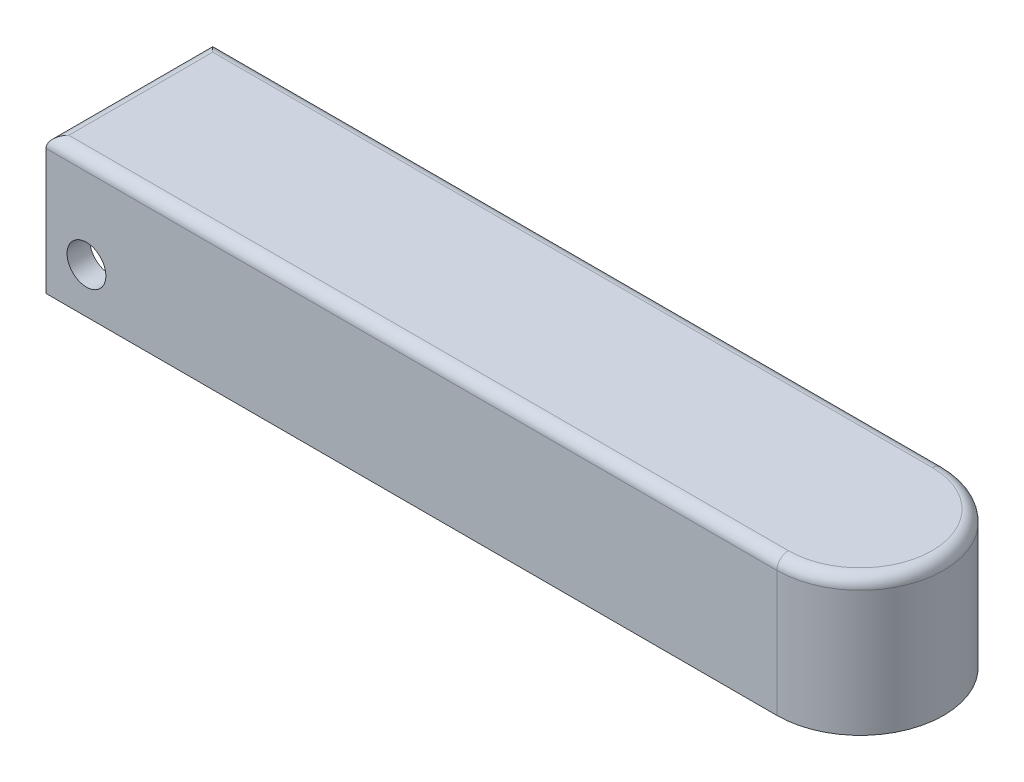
ISO-10303-21;
HEADER;
FILE_DESCRIPTION(('STEP AP214'),'2;1');
FILE_NAME('part.step','',(''),(''),'','','');
FILE_SCHEMA(('AUTOMOTIVE_DESIGN { 1 0 10303 214 1 1 1 1 }'));
ENDSEC;
DATA;
#1=APPLICATION_CONTEXT('core data for automotive mechanical design processes');
#2=APPLICATION_PROTOCOL_DEFINITION('international standard','automotive_design',2000,#1);
#3=PRODUCT_CONTEXT('',#1,'mechanical');
#4=PRODUCT('Part','Part','',(#3));
#5=PRODUCT_RELATED_PRODUCT_CATEGORY('part','',(#4));
#6=PRODUCT_DEFINITION_FORMATION('','',#4);
#7=PRODUCT_DEFINITION_CONTEXT('part definition',#1,'design');
#8=PRODUCT_DEFINITION('design','',#6,#7);
#9=PRODUCT_DEFINITION_SHAPE('','',#8);
#10=(LENGTH_UNIT() NAMED_UNIT(*) SI_UNIT(.MILLI.,.METRE.));
#11=(NAMED_UNIT(*) PLANE_ANGLE_UNIT() SI_UNIT($,.RADIAN.));
#12=(NAMED_UNIT(*) SI_UNIT($,.STERADIAN.) SOLID_ANGLE_UNIT());
#13=UNCERTAINTY_MEASURE_WITH_UNIT(LENGTH_MEASURE(1.E-05),#10,'distance_accuracy_value','');
#14=(GEOMETRIC_REPRESENTATION_CONTEXT(3) GLOBAL_UNCERTAINTY_ASSIGNED_CONTEXT((#13)) GLOBAL_UNIT_ASSIGNED_CONTEXT((#10,
#11,#12)) REPRESENTATION_CONTEXT('',''));
#15=CARTESIAN_POINT('',(0.,0.,0.));
#16=DIRECTION('',(0.,0.,1.));
#17=DIRECTION('',(1.,0.,0.));
#18=AXIS2_PLACEMENT_3D('',#15,#16,#17);
#19=CARTESIAN_POINT('',(0.,76.2,0.));
#20=DIRECTION('',(1.,0.,0.));
#21=DIRECTION('',(0.,0.,-1.));
#22=AXIS2_PLACEMENT_3D('',#19,#20,#21);
#23=PLANE('',#22);
#24=DIRECTION('',(0.,-1.,0.));
#25=VECTOR('',#24,1.);
#26=CARTESIAN_POINT('',(0.,76.2,0.));
#27=LINE('',#26,#25);
#28=CARTESIAN_POINT('',(0.,69.85,0.));
#29=VERTEX_POINT('',#28);
#30=CARTESIAN_POINT('',(0.,0.,0.));
#31=VERTEX_POINT('',#30);
#32=EDGE_CURVE('E196',#29,#31,#27,.T.);
#33=ORIENTED_EDGE('',*,*,#32,.F.);
#34=DIRECTION('',(0.,0.,1.));
#35=VECTOR('',#34,1.);
#36=CARTESIAN_POINT('',(0.,69.85,0.));
#37=LINE('',#36,#35);
#38=CARTESIAN_POINT('',(0.,69.85,-92.71));
#39=VERTEX_POINT('',#38);
#40=EDGE_CURVE('E39',#29,#39,#37,.F.);
#41=ORIENTED_EDGE('',*,*,#40,.T.);
#42=DIRECTION('',(0.,-1.,0.));
#43=VECTOR('',#42,1.);
#44=CARTESIAN_POINT('',(0.,76.2,-92.71));
#45=LINE('',#44,#43);
#46=CARTESIAN_POINT('',(0.,0.,-92.71));
#47=VERTEX_POINT('',#46);
#48=EDGE_CURVE('E190',#39,#47,#45,.T.);
#49=ORIENTED_EDGE('',*,*,#48,.T.);
#50=DIRECTION('',(0.,0.,1.));
#51=VECTOR('',#50,1.);
#52=CARTESIAN_POINT('',(0.,0.,0.));
#53=LINE('',#52,#51);
#54=CARTESIAN_POINT('',(0.,0.,-80.01));
#55=VERTEX_POINT('',#54);
#56=EDGE_CURVE('E126',#47,#55,#53,.T.);
#57=ORIENTED_EDGE('',*,*,#56,.T.);
#58=DIRECTION('',(0.,-1.,0.));
#59=VECTOR('',#58,1.);
#60=CARTESIAN_POINT('',(0.,38.1,-80.01));
#61=LINE('',#60,#59);
#62=CARTESIAN_POINT('',(0.,63.5,-80.01));
#63=VERTEX_POINT('',#62);
#64=EDGE_CURVE('E120',#63,#55,#61,.T.);
#65=ORIENTED_EDGE('',*,*,#64,.F.);
#66=DIRECTION('',(0.,0.,-1.));
#67=VECTOR('',#66,1.);
#68=CARTESIAN_POINT('',(0.,63.5,-80.01));
#69=LINE('',#68,#67);
#70=CARTESIAN_POINT('',(0.,63.5,-12.7));
#71=VERTEX_POINT('',#70);
#72=EDGE_CURVE('E124',#71,#63,#69,.T.);
#73=ORIENTED_EDGE('',*,*,#72,.F.);
#74=DIRECTION('',(0.,-1.,0.));
#75=VECTOR('',#74,1.);
#76=CARTESIAN_POINT('',(0.,38.1,-12.7));
#77=LINE('',#76,#75);
#78=CARTESIAN_POINT('',(0.,0.,-12.7));
#79=VERTEX_POINT('',#78);
#80=EDGE_CURVE('E131',#71,#79,#77,.T.);
#81=ORIENTED_EDGE('',*,*,#80,.T.);
#82=EDGE_CURVE('E177',#79,#31,#53,.T.);
#83=ORIENTED_EDGE('',*,*,#82,.T.);
#84=EDGE_LOOP('',(#33,#41,#49,#57,#65,#73,#81,#83));
#85=FACE_BOUND('',#84,.T.);
#86=ADVANCED_FACE('F30',(#85),#23,.F.);
#87=CARTESIAN_POINT('',(0.,76.2,0.));
#88=DIRECTION('',(0.,0.,-1.));
#89=DIRECTION('',(-1.,0.,0.));
#90=AXIS2_PLACEMENT_3D('',#87,#88,#89);
#91=PLANE('',#90);
#92=CARTESIAN_POINT('',(22.4900013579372,25.1025379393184,0.));
#93=DIRECTION('',(0.,0.,1.));
#94=DIRECTION('',(1.,0.,0.));
#95=AXIS2_PLACEMENT_3D('',#92,#93,#94);
#96=CIRCLE('',#95,10.7961289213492);
#97=CARTESIAN_POINT('',(33.2861302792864,25.1025379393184,0.));
#98=VERTEX_POINT('',#97);
#99=EDGE_CURVE('E226',#98,#98,#96,.T.);
#100=ORIENTED_EDGE('',*,*,#99,.F.);
#101=EDGE_LOOP('',(#100));
#102=FACE_BOUND('',#101,.T.);
#103=DIRECTION('',(0.,-1.,0.));
#104=VECTOR('',#103,1.);
#105=CARTESIAN_POINT('',(406.4,76.2,0.));
#106=LINE('',#105,#104);
#107=CARTESIAN_POINT('',(406.4,69.85,0.));
#108=VERTEX_POINT('',#107);
#109=CARTESIAN_POINT('',(406.4,0.,0.));
#110=VERTEX_POINT('',#109);
#111=EDGE_CURVE('E194',#108,#110,#106,.T.);
#112=ORIENTED_EDGE('',*,*,#111,.F.);
#113=DIRECTION('',(1.,0.,0.));
#114=VECTOR('',#113,1.);
#115=CARTESIAN_POINT('',(0.,69.85,0.));
#116=LINE('',#115,#114);
#117=EDGE_CURVE('E11',#108,#29,#116,.F.);
#118=ORIENTED_EDGE('',*,*,#117,.T.);
#119=ORIENTED_EDGE('',*,*,#32,.T.);
#120=DIRECTION('',(1.,0.,0.));
#121=VECTOR('',#120,1.);
#122=CARTESIAN_POINT('',(0.,0.,0.));
#123=LINE('',#122,#121);
#124=EDGE_CURVE('E181',#31,#110,#123,.T.);
#125=ORIENTED_EDGE('',*,*,#124,.T.);
#126=EDGE_LOOP('',(#112,#118,#119,#125));
#127=FACE_BOUND('',#126,.T.);
#128=ADVANCED_FACE('F263',(#102,#127),#91,.F.);
#129=CARTESIAN_POINT('',(406.4,76.2,-46.355));
#130=DIRECTION('',(0.,-1.,0.));
#131=DIRECTION('',(0.,0.,-1.));
#132=AXIS2_PLACEMENT_3D('',#129,#130,#131);
#133=CYLINDRICAL_SURFACE('',#132,46.355);
#134=DIRECTION('',(0.,-1.,0.));
#135=VECTOR('',#134,1.);
#136=CARTESIAN_POINT('',(406.4,76.2,-92.71));
#137=LINE('',#136,#135);
#138=CARTESIAN_POINT('',(406.4,69.85,-92.71));
#139=VERTEX_POINT('',#138);
#140=CARTESIAN_POINT('',(406.4,0.,-92.71));
#141=VERTEX_POINT('',#140);
#142=EDGE_CURVE('E192',#139,#141,#137,.T.);
#143=ORIENTED_EDGE('',*,*,#142,.F.);
#144=CARTESIAN_POINT('',(406.4,69.85,-46.355));
#145=DIRECTION('',(0.,-1.,0.));
#146=DIRECTION('',(0.,0.,-1.));
#147=AXIS2_PLACEMENT_3D('',#144,#145,#146);
#148=CIRCLE('',#147,46.355);
#149=EDGE_CURVE('E53',#139,#108,#148,.T.);
#150=ORIENTED_EDGE('',*,*,#149,.T.);
#151=ORIENTED_EDGE('',*,*,#111,.T.);
#152=CARTESIAN_POINT('',(406.4,0.,-46.355));
#153=DIRECTION('',(0.,1.,0.));
#154=DIRECTION('',(0.,0.,-1.));
#155=AXIS2_PLACEMENT_3D('',#152,#153,#154);
#156=CIRCLE('',#155,46.355);
#157=EDGE_CURVE('E184',#110,#141,#156,.T.);
#158=ORIENTED_EDGE('',*,*,#157,.T.);
#159=EDGE_LOOP('',(#143,#150,#151,#158));
#160=FACE_BOUND('',#159,.T.);
#161=ADVANCED_FACE('F268',(#160),#133,.T.);
#162=CARTESIAN_POINT('',(0.,76.2,-92.71));
#163=DIRECTION('',(0.,0.,1.));
#164=DIRECTION('',(1.,0.,0.));
#165=AXIS2_PLACEMENT_3D('',#162,#163,#164);
#166=PLANE('',#165);
#167=CARTESIAN_POINT('',(22.4900013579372,25.1025379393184,-92.71));
#168=DIRECTION('',(0.,0.,1.));
#169=DIRECTION('',(1.,0.,0.));
#170=AXIS2_PLACEMENT_3D('',#167,#168,#169);
#171=CIRCLE('',#170,10.7961289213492);
#172=CARTESIAN_POINT('',(33.2861302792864,25.1025379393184,-92.71));
#173=VERTEX_POINT('',#172);
#174=EDGE_CURVE('E202',#173,#173,#171,.T.);
#175=ORIENTED_EDGE('',*,*,#174,.T.);
#176=EDGE_LOOP('',(#175));
#177=FACE_BOUND('',#176,.T.);
#178=ORIENTED_EDGE('',*,*,#48,.F.);
#179=DIRECTION('',(-1.,0.,0.));
#180=VECTOR('',#179,1.);
#181=CARTESIAN_POINT('',(0.,69.85,-92.71));
#182=LINE('',#181,#180);
#183=EDGE_CURVE('E211',#39,#139,#182,.F.);
#184=ORIENTED_EDGE('',*,*,#183,.T.);
#185=ORIENTED_EDGE('',*,*,#142,.T.);
#186=DIRECTION('',(-1.,0.,0.));
#187=VECTOR('',#186,1.);
#188=CARTESIAN_POINT('',(0.,0.,-92.71));
#189=LINE('',#188,#187);
#190=EDGE_CURVE('E187',#141,#47,#189,.T.);
#191=ORIENTED_EDGE('',*,*,#190,.T.);
#192=EDGE_LOOP('',(#178,#184,#185,#191));
#193=FACE_BOUND('',#192,.T.);
#194=ADVANCED_FACE('F237',(#177,#193),#166,.F.);
#195=CARTESIAN_POINT('',(406.4,76.2,-46.355));
#196=DIRECTION('',(0.,-1.,0.));
#197=DIRECTION('',(0.,0.,-1.));
#198=AXIS2_PLACEMENT_3D('',#195,#196,#197);
#199=PLANE('',#198);
#200=CARTESIAN_POINT('',(406.4,76.2,-46.355));
#201=DIRECTION('',(0.,-1.,0.));
#202=DIRECTION('',(0.,0.,-1.));
#203=AXIS2_PLACEMENT_3D('',#200,#201,#202);
#204=CIRCLE('',#203,40.005);
#205=CARTESIAN_POINT('',(406.4,76.2,-6.35));
#206=VERTEX_POINT('',#205);
#207=CARTESIAN_POINT('',(406.4,76.2,-86.36));
#208=VERTEX_POINT('',#207);
#209=EDGE_CURVE('E206',#206,#208,#204,.F.);
#210=ORIENTED_EDGE('',*,*,#209,.T.);
#211=DIRECTION('',(-1.,0.,0.));
#212=VECTOR('',#211,1.);
#213=CARTESIAN_POINT('',(406.4,76.2,-86.36));
#214=LINE('',#213,#212);
#215=CARTESIAN_POINT('',(6.35000000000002,76.2,-86.36));
#216=VERTEX_POINT('',#215);
#217=EDGE_CURVE('E208',#208,#216,#214,.T.);
#218=ORIENTED_EDGE('',*,*,#217,.T.);
#219=DIRECTION('',(0.,0.,1.));
#220=VECTOR('',#219,1.);
#221=CARTESIAN_POINT('',(6.35000000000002,76.2,-46.355));
#222=LINE('',#221,#220);
#223=CARTESIAN_POINT('',(6.35000000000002,76.2,-6.35));
#224=VERTEX_POINT('',#223);
#225=EDGE_CURVE('E204',#216,#224,#222,.T.);
#226=ORIENTED_EDGE('',*,*,#225,.T.);
#227=DIRECTION('',(1.,0.,0.));
#228=VECTOR('',#227,1.);
#229=CARTESIAN_POINT('',(406.4,76.2,-6.35));
#230=LINE('',#229,#228);
#231=EDGE_CURVE('E198',#224,#206,#230,.T.);
#232=ORIENTED_EDGE('',*,*,#231,.T.);
#233=EDGE_LOOP('',(#210,#218,#226,#232));
#234=FACE_BOUND('',#233,.T.);
#235=ADVANCED_FACE('F297',(#234),#199,.F.);
#236=CARTESIAN_POINT('',(406.4,0.,-46.355));
#237=DIRECTION('',(0.,-1.,0.));
#238=DIRECTION('',(0.,0.,-1.));
#239=AXIS2_PLACEMENT_3D('',#236,#237,#238);
#240=PLANE('',#239);
#241=DIRECTION('',(-1.,0.,0.));
#242=VECTOR('',#241,1.);
#243=CARTESIAN_POINT('',(406.4,0.,-12.7));
#244=LINE('',#243,#242);
#245=CARTESIAN_POINT('',(406.4,0.,-12.7));
#246=VERTEX_POINT('',#245);
#247=EDGE_CURVE('E159',#246,#79,#244,.T.);
#248=ORIENTED_EDGE('',*,*,#247,.F.);
#249=CARTESIAN_POINT('',(406.4,0.,-46.355));
#250=DIRECTION('',(0.,-1.,0.));
#251=DIRECTION('',(0.,0.,-1.));
#252=AXIS2_PLACEMENT_3D('',#249,#250,#251);
#253=CIRCLE('',#252,33.655);
#254=CARTESIAN_POINT('',(406.4,0.,-80.01));
#255=VERTEX_POINT('',#254);
#256=EDGE_CURVE('E165',#255,#246,#253,.T.);
#257=ORIENTED_EDGE('',*,*,#256,.F.);
#258=DIRECTION('',(1.,0.,0.));
#259=VECTOR('',#258,1.);
#260=CARTESIAN_POINT('',(0.,0.,-80.01));
#261=LINE('',#260,#259);
#262=EDGE_CURVE('E171',#55,#255,#261,.T.);
#263=ORIENTED_EDGE('',*,*,#262,.F.);
#264=ORIENTED_EDGE('',*,*,#56,.F.);
#265=ORIENTED_EDGE('',*,*,#190,.F.);
#266=ORIENTED_EDGE('',*,*,#157,.F.);
#267=ORIENTED_EDGE('',*,*,#124,.F.);
#268=ORIENTED_EDGE('',*,*,#82,.F.);
#269=EDGE_LOOP('',(#248,#257,#263,#264,#265,#266,#267,#268));
#270=FACE_BOUND('',#269,.T.);
#271=ADVANCED_FACE('F299',(#270),#240,.T.);
#272=CARTESIAN_POINT('',(406.4,38.1,-12.7));
#273=DIRECTION('',(0.,0.,1.));
#274=DIRECTION('',(1.,0.,0.));
#275=AXIS2_PLACEMENT_3D('',#272,#273,#274);
#276=PLANE('',#275);
#277=CARTESIAN_POINT('',(22.4900013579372,25.1025379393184,-12.7));
#278=DIRECTION('',(0.,0.,1.));
#279=DIRECTION('',(1.,0.,0.));
#280=AXIS2_PLACEMENT_3D('',#277,#278,#279);
#281=CIRCLE('',#280,10.7961289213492);
#282=CARTESIAN_POINT('',(33.2861302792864,25.1025379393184,-12.7));
#283=VERTEX_POINT('',#282);
#284=EDGE_CURVE('E150',#283,#283,#281,.T.);
#285=ORIENTED_EDGE('',*,*,#284,.T.);
#286=EDGE_LOOP('',(#285));
#287=FACE_BOUND('',#286,.T.);
#288=ORIENTED_EDGE('',*,*,#247,.T.);
#289=ORIENTED_EDGE('',*,*,#80,.F.);
#290=DIRECTION('',(-1.,0.,0.));
#291=VECTOR('',#290,1.);
#292=CARTESIAN_POINT('',(0.,63.5,-12.7));
#293=LINE('',#292,#291);
#294=CARTESIAN_POINT('',(359.043879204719,63.5,-12.7));
#295=VERTEX_POINT('',#294);
#296=EDGE_CURVE('E146',#295,#71,#293,.T.);
#297=ORIENTED_EDGE('',*,*,#296,.F.);
#298=DIRECTION('',(0.,-1.,0.));
#299=VECTOR('',#298,1.);
#300=CARTESIAN_POINT('',(359.043879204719,63.5,-12.7));
#301=LINE('',#300,#299);
#302=CARTESIAN_POINT('',(359.043879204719,38.1,-12.7));
#303=VERTEX_POINT('',#302);
#304=EDGE_CURVE('E157',#295,#303,#301,.T.);
#305=ORIENTED_EDGE('',*,*,#304,.T.);
#306=DIRECTION('',(-1.,0.,0.));
#307=VECTOR('',#306,1.);
#308=CARTESIAN_POINT('',(406.4,38.1,-12.7));
#309=LINE('',#308,#307);
#310=CARTESIAN_POINT('',(406.4,38.1,-12.7));
#311=VERTEX_POINT('',#310);
#312=EDGE_CURVE('E161',#311,#303,#309,.T.);
#313=ORIENTED_EDGE('',*,*,#312,.F.);
#314=DIRECTION('',(0.,-1.,0.));
#315=VECTOR('',#314,1.);
#316=CARTESIAN_POINT('',(406.4,38.1,-12.7));
#317=LINE('',#316,#315);
#318=EDGE_CURVE('E175',#311,#246,#317,.T.);
#319=ORIENTED_EDGE('',*,*,#318,.T.);
#320=EDGE_LOOP('',(#288,#289,#297,#305,#313,#319));
#321=FACE_BOUND('',#320,.T.);
#322=ADVANCED_FACE('F258',(#287,#321),#276,.F.);
#323=CARTESIAN_POINT('',(406.4,38.1,-46.355));
#324=DIRECTION('',(0.,-1.,0.));
#325=DIRECTION('',(0.,0.,-1.));
#326=AXIS2_PLACEMENT_3D('',#323,#324,#325);
#327=CYLINDRICAL_SURFACE('',#326,33.655);
#328=ORIENTED_EDGE('',*,*,#256,.T.);
#329=ORIENTED_EDGE('',*,*,#318,.F.);
#330=CARTESIAN_POINT('',(406.4,38.1,-46.355));
#331=DIRECTION('',(0.,-1.,0.));
#332=DIRECTION('',(0.,0.,-1.));
#333=AXIS2_PLACEMENT_3D('',#330,#331,#332);
#334=CIRCLE('',#333,33.655);
#335=CARTESIAN_POINT('',(406.4,38.1,-80.01));
#336=VERTEX_POINT('',#335);
#337=EDGE_CURVE('E167',#336,#311,#334,.T.);
#338=ORIENTED_EDGE('',*,*,#337,.F.);
#339=DIRECTION('',(0.,-1.,0.));
#340=VECTOR('',#339,1.);
#341=CARTESIAN_POINT('',(406.4,38.1,-80.01));
#342=LINE('',#341,#340);
#343=EDGE_CURVE('E130',#336,#255,#342,.T.);
#344=ORIENTED_EDGE('',*,*,#343,.T.);
#345=EDGE_LOOP('',(#328,#329,#338,#344));
#346=FACE_BOUND('',#345,.T.);
#347=ADVANCED_FACE('F249',(#346),#327,.F.);
#348=CARTESIAN_POINT('',(0.,38.1,-80.01));
#349=DIRECTION('',(0.,0.,-1.));
#350=DIRECTION('',(-1.,0.,0.));
#351=AXIS2_PLACEMENT_3D('',#348,#349,#350);
#352=PLANE('',#351);
#353=CARTESIAN_POINT('',(22.4900013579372,25.1025379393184,-80.01));
#354=DIRECTION('',(0.,0.,-1.));
#355=DIRECTION('',(-1.,0.,0.));
#356=AXIS2_PLACEMENT_3D('',#353,#354,#355);
#357=CIRCLE('',#356,10.7961289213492);
#358=CARTESIAN_POINT('',(33.2861302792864,25.1025379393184,-80.01));
#359=VERTEX_POINT('',#358);
#360=EDGE_CURVE('E199',#359,#359,#357,.T.);
#361=ORIENTED_EDGE('',*,*,#360,.T.);
#362=EDGE_LOOP('',(#361));
#363=FACE_BOUND('',#362,.T.);
#364=ORIENTED_EDGE('',*,*,#262,.T.);
#365=ORIENTED_EDGE('',*,*,#343,.F.);
#366=DIRECTION('',(1.,0.,0.));
#367=VECTOR('',#366,1.);
#368=CARTESIAN_POINT('',(0.,38.1,-80.01));
#369=LINE('',#368,#367);
#370=CARTESIAN_POINT('',(359.043879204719,38.1,-80.01));
#371=VERTEX_POINT('',#370);
#372=EDGE_CURVE('E164',#371,#336,#369,.T.);
#373=ORIENTED_EDGE('',*,*,#372,.F.);
#374=DIRECTION('',(0.,-1.,0.));
#375=VECTOR('',#374,1.);
#376=CARTESIAN_POINT('',(359.043879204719,63.5,-80.01));
#377=LINE('',#376,#375);
#378=CARTESIAN_POINT('',(359.043879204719,63.5,-80.01));
#379=VERTEX_POINT('',#378);
#380=EDGE_CURVE('E137',#379,#371,#377,.T.);
#381=ORIENTED_EDGE('',*,*,#380,.F.);
#382=DIRECTION('',(1.,0.,0.));
#383=VECTOR('',#382,1.);
#384=CARTESIAN_POINT('',(0.,63.5,-80.01));
#385=LINE('',#384,#383);
#386=EDGE_CURVE('E134',#63,#379,#385,.T.);
#387=ORIENTED_EDGE('',*,*,#386,.F.);
#388=ORIENTED_EDGE('',*,*,#64,.T.);
#389=EDGE_LOOP('',(#364,#365,#373,#381,#387,#388));
#390=FACE_BOUND('',#389,.T.);
#391=ADVANCED_FACE('F135',(#363,#390),#352,.F.);
#392=CARTESIAN_POINT('',(406.4,38.1,-46.355));
#393=DIRECTION('',(0.,-1.,0.));
#394=DIRECTION('',(0.,0.,-1.));
#395=AXIS2_PLACEMENT_3D('',#392,#393,#394);
#396=PLANE('',#395);
#397=DIRECTION('',(0.,0.,1.));
#398=VECTOR('',#397,1.);
#399=CARTESIAN_POINT('',(359.043879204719,38.1,-80.01));
#400=LINE('',#399,#398);
#401=EDGE_CURVE('E147',#371,#303,#400,.T.);
#402=ORIENTED_EDGE('',*,*,#401,.F.);
#403=ORIENTED_EDGE('',*,*,#372,.T.);
#404=ORIENTED_EDGE('',*,*,#337,.T.);
#405=ORIENTED_EDGE('',*,*,#312,.T.);
#406=EDGE_LOOP('',(#402,#403,#404,#405));
#407=FACE_BOUND('',#406,.T.);
#408=ADVANCED_FACE('F248',(#407),#396,.T.);
#409=CARTESIAN_POINT('',(359.043879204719,63.5,-80.01));
#410=DIRECTION('',(1.,0.,0.));
#411=DIRECTION('',(0.,0.,-1.));
#412=AXIS2_PLACEMENT_3D('',#409,#410,#411);
#413=PLANE('',#412);
#414=ORIENTED_EDGE('',*,*,#401,.T.);
#415=ORIENTED_EDGE('',*,*,#304,.F.);
#416=DIRECTION('',(0.,0.,1.));
#417=VECTOR('',#416,1.);
#418=CARTESIAN_POINT('',(359.043879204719,63.5,-80.01));
#419=LINE('',#418,#417);
#420=EDGE_CURVE('E141',#379,#295,#419,.T.);
#421=ORIENTED_EDGE('',*,*,#420,.F.);
#422=ORIENTED_EDGE('',*,*,#380,.T.);
#423=EDGE_LOOP('',(#414,#415,#421,#422));
#424=FACE_BOUND('',#423,.T.);
#425=ADVANCED_FACE('F255',(#424),#413,.F.);
#426=CARTESIAN_POINT('',(0.,63.5,-12.7));
#427=DIRECTION('',(0.,1.,0.));
#428=DIRECTION('',(0.,0.,1.));
#429=AXIS2_PLACEMENT_3D('',#426,#427,#428);
#430=PLANE('',#429);
#431=ORIENTED_EDGE('',*,*,#72,.T.);
#432=ORIENTED_EDGE('',*,*,#386,.T.);
#433=ORIENTED_EDGE('',*,*,#420,.T.);
#434=ORIENTED_EDGE('',*,*,#296,.T.);
#435=EDGE_LOOP('',(#431,#432,#433,#434));
#436=FACE_BOUND('',#435,.T.);
#437=ADVANCED_FACE('F144',(#436),#430,.F.);
#438=CARTESIAN_POINT('',(22.4900013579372,25.1025379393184,-92.71));
#439=DIRECTION('',(0.,0.,1.));
#440=DIRECTION('',(1.,0.,0.));
#441=AXIS2_PLACEMENT_3D('',#438,#439,#440);
#442=CYLINDRICAL_SURFACE('',#441,10.7961289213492);
#443=CARTESIAN_POINT('',(33.2861302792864,25.1025379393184,-92.71));
#444=CARTESIAN_POINT('',(33.2861302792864,25.1025379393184,-92.5777083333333));
#445=CARTESIAN_POINT('',(33.2861302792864,25.1025379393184,-92.4454166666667));
#446=CARTESIAN_POINT('',(33.2861302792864,25.1025379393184,-92.1808333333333));
#447=CARTESIAN_POINT('',(33.2861302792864,25.1025379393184,-92.0485416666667));
#448=CARTESIAN_POINT('',(33.2861302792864,25.1025379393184,-91.7839583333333));
#449=CARTESIAN_POINT('',(33.2861302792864,25.1025379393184,-91.6516666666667));
#450=CARTESIAN_POINT('',(33.2861302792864,25.1025379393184,-91.3870833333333));
#451=CARTESIAN_POINT('',(33.2861302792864,25.1025379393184,-91.2547916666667));
#452=CARTESIAN_POINT('',(33.2861302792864,25.1025379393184,-90.9902083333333));
#453=CARTESIAN_POINT('',(33.2861302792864,25.1025379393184,-90.8579166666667));
#454=CARTESIAN_POINT('',(33.2861302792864,25.1025379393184,-90.5933333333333));
#455=CARTESIAN_POINT('',(33.2861302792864,25.1025379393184,-90.4610416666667));
#456=CARTESIAN_POINT('',(33.2861302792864,25.1025379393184,-90.1964583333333));
#457=CARTESIAN_POINT('',(33.2861302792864,25.1025379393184,-90.0641666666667));
#458=CARTESIAN_POINT('',(33.2861302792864,25.1025379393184,-89.7995833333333));
#459=CARTESIAN_POINT('',(33.2861302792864,25.1025379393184,-89.6672916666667));
#460=CARTESIAN_POINT('',(33.2861302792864,25.1025379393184,-89.4027083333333));
#461=CARTESIAN_POINT('',(33.2861302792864,25.1025379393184,-89.2704166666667));
#462=CARTESIAN_POINT('',(33.2861302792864,25.1025379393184,-89.0058333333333));
#463=CARTESIAN_POINT('',(33.2861302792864,25.1025379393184,-88.8735416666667));
#464=CARTESIAN_POINT('',(33.2861302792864,25.1025379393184,-88.6089583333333));
#465=CARTESIAN_POINT('',(33.2861302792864,25.1025379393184,-88.4766666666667));
#466=CARTESIAN_POINT('',(33.2861302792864,25.1025379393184,-88.2120833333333));
#467=CARTESIAN_POINT('',(33.2861302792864,25.1025379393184,-88.0797916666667));
#468=CARTESIAN_POINT('',(33.2861302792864,25.1025379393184,-87.8152083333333));
#469=CARTESIAN_POINT('',(33.2861302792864,25.1025379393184,-87.6829166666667));
#470=CARTESIAN_POINT('',(33.2861302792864,25.1025379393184,-87.4183333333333));
#471=CARTESIAN_POINT('',(33.2861302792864,25.1025379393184,-87.2860416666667));
#472=CARTESIAN_POINT('',(33.2861302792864,25.1025379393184,-87.0214583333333));
#473=CARTESIAN_POINT('',(33.2861302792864,25.1025379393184,-86.8891666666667));
#474=CARTESIAN_POINT('',(33.2861302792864,25.1025379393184,-86.6245833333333));
#475=CARTESIAN_POINT('',(33.2861302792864,25.1025379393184,-86.4922916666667));
#476=CARTESIAN_POINT('',(33.2861302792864,25.1025379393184,-86.2277083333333));
#477=CARTESIAN_POINT('',(33.2861302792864,25.1025379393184,-86.0954166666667));
#478=CARTESIAN_POINT('',(33.2861302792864,25.1025379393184,-85.8308333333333));
#479=CARTESIAN_POINT('',(33.2861302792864,25.1025379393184,-85.6985416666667));
#480=CARTESIAN_POINT('',(33.2861302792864,25.1025379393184,-85.4339583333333));
#481=CARTESIAN_POINT('',(33.2861302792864,25.1025379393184,-85.3016666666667));
#482=CARTESIAN_POINT('',(33.2861302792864,25.1025379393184,-85.0370833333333));
#483=CARTESIAN_POINT('',(33.2861302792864,25.1025379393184,-84.9047916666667));
#484=CARTESIAN_POINT('',(33.2861302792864,25.1025379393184,-84.6402083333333));
#485=CARTESIAN_POINT('',(33.2861302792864,25.1025379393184,-84.5079166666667));
#486=CARTESIAN_POINT('',(33.2861302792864,25.1025379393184,-84.2433333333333));
#487=CARTESIAN_POINT('',(33.2861302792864,25.1025379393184,-84.1110416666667));
#488=CARTESIAN_POINT('',(33.2861302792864,25.1025379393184,-83.8464583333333));
#489=CARTESIAN_POINT('',(33.2861302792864,25.1025379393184,-83.7141666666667));
#490=CARTESIAN_POINT('',(33.2861302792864,25.1025379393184,-83.4495833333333));
#491=CARTESIAN_POINT('',(33.2861302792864,25.1025379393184,-83.3172916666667));
#492=CARTESIAN_POINT('',(33.2861302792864,25.1025379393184,-83.0527083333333));
#493=CARTESIAN_POINT('',(33.2861302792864,25.1025379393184,-82.9204166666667));
#494=CARTESIAN_POINT('',(33.2861302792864,25.1025379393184,-82.6558333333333));
#495=CARTESIAN_POINT('',(33.2861302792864,25.1025379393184,-82.5235416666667));
#496=CARTESIAN_POINT('',(33.2861302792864,25.1025379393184,-82.2589583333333));
#497=CARTESIAN_POINT('',(33.2861302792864,25.1025379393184,-82.1266666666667));
#498=CARTESIAN_POINT('',(33.2861302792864,25.1025379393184,-81.8620833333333));
#499=CARTESIAN_POINT('',(33.2861302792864,25.1025379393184,-81.7297916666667));
#500=CARTESIAN_POINT('',(33.2861302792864,25.1025379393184,-81.4652083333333));
#501=CARTESIAN_POINT('',(33.2861302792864,25.1025379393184,-81.3329166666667));
#502=CARTESIAN_POINT('',(33.2861302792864,25.1025379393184,-81.0683333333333));
#503=CARTESIAN_POINT('',(33.2861302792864,25.1025379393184,-80.9360416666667));
#504=CARTESIAN_POINT('',(33.2861302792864,25.1025379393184,-80.6714583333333));
#505=CARTESIAN_POINT('',(33.2861302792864,25.1025379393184,-80.5391666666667));
#506=CARTESIAN_POINT('',(33.2861302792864,25.1025379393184,-80.2745833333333));
#507=CARTESIAN_POINT('',(33.2861302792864,25.1025379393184,-80.1422916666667));
#508=CARTESIAN_POINT('',(33.2861302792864,25.1025379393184,-80.01));
#509=B_SPLINE_CURVE_WITH_KNOTS('',3,(#443,#444,#445,#446,#447,#448,#449,#450,#451,#452,#453,
#454,#455,#456,#457,#458,#459,#460,#461,#462,#463,#464,#465,#466,#467,#468,#469,#470,#471,#472,
#473,#474,#475,#476,#477,#478,#479,#480,#481,#482,#483,#484,#485,#486,#487,#488,#489,#490,#491,
#492,#493,#494,#495,#496,#497,#498,#499,#500,#501,#502,#503,#504,#505,#506,#507,#508),
.UNSPECIFIED.,.F.,.F.,(4,2,2,2,2,2,2,2,2,2,2,2,2,2,2,2,2,2,2,2,2,2,2,2,2,2,2,2,2,2,2,2,4),(0.,
0.396875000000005,0.79375000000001,1.19062500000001,1.58750000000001,1.98437500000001,
2.38125000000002,2.77812500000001,3.17500000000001,3.57187500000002,3.96875000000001,
4.36562500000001,4.76250000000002,5.15937500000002,5.55625000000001,5.95312500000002,
6.35000000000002,6.74687500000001,7.14375000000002,7.54062500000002,7.93750000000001,
8.33437500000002,8.73125000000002,9.12812500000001,9.52500000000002,9.92187500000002,10.31875,
10.715625,11.1125,11.509375,11.90625,12.303125,12.7),.UNSPECIFIED.);
#510=EDGE_CURVE('BSEAM240',#173,#359,#509,.T.);
#511=ORIENTED_EDGE('',*,*,#174,.F.);
#512=ORIENTED_EDGE('',*,*,#360,.F.);
#513=ORIENTED_EDGE('',*,*,#510,.T.);
#514=ORIENTED_EDGE('',*,*,#510,.F.);
#515=EDGE_LOOP('',(#511,#513,#512,#514));
#516=FACE_BOUND('',#515,.T.);
#517=ADVANCED_FACE('F240',(#516),#442,.F.);
#518=CARTESIAN_POINT('',(33.2861302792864,25.1025379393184,0.));
#519=CARTESIAN_POINT('',(33.2861302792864,25.1025379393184,-0.132291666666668));
#520=CARTESIAN_POINT('',(33.2861302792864,25.1025379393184,-0.264583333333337));
#521=CARTESIAN_POINT('',(33.2861302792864,25.1025379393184,-0.529166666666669));
#522=CARTESIAN_POINT('',(33.2861302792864,25.1025379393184,-0.661458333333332));
#523=CARTESIAN_POINT('',(33.2861302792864,25.1025379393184,-0.926041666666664));
#524=CARTESIAN_POINT('',(33.2861302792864,25.1025379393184,-1.05833333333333));
#525=CARTESIAN_POINT('',(33.2861302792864,25.1025379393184,-1.32291666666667));
#526=CARTESIAN_POINT('',(33.2861302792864,25.1025379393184,-1.45520833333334));
#527=CARTESIAN_POINT('',(33.2861302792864,25.1025379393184,-1.71979166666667));
#528=CARTESIAN_POINT('',(33.2861302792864,25.1025379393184,-1.85208333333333));
#529=CARTESIAN_POINT('',(33.2861302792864,25.1025379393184,-2.11666666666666));
#530=CARTESIAN_POINT('',(33.2861302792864,25.1025379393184,-2.24895833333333));
#531=CARTESIAN_POINT('',(33.2861302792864,25.1025379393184,-2.51354166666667));
#532=CARTESIAN_POINT('',(33.2861302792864,25.1025379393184,-2.64583333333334));
#533=CARTESIAN_POINT('',(33.2861302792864,25.1025379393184,-2.91041666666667));
#534=CARTESIAN_POINT('',(33.2861302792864,25.1025379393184,-3.04270833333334));
#535=CARTESIAN_POINT('',(33.2861302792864,25.1025379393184,-3.30729166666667));
#536=CARTESIAN_POINT('',(33.2861302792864,25.1025379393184,-3.43958333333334));
#537=CARTESIAN_POINT('',(33.2861302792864,25.1025379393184,-3.70416666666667));
#538=CARTESIAN_POINT('',(33.2861302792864,25.1025379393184,-3.83645833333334));
#539=CARTESIAN_POINT('',(33.2861302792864,25.1025379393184,-4.10104166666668));
#540=CARTESIAN_POINT('',(33.2861302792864,25.1025379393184,-4.23333333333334));
#541=CARTESIAN_POINT('',(33.2861302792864,25.1025379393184,-4.49791666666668));
#542=CARTESIAN_POINT('',(33.2861302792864,25.1025379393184,-4.63020833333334));
#543=CARTESIAN_POINT('',(33.2861302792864,25.1025379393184,-4.89479166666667));
#544=CARTESIAN_POINT('',(33.2861302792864,25.1025379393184,-5.02708333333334));
#545=CARTESIAN_POINT('',(33.2861302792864,25.1025379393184,-5.29166666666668));
#546=CARTESIAN_POINT('',(33.2861302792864,25.1025379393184,-5.42395833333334));
#547=CARTESIAN_POINT('',(33.2861302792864,25.1025379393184,-5.68854166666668));
#548=CARTESIAN_POINT('',(33.2861302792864,25.1025379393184,-5.82083333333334));
#549=CARTESIAN_POINT('',(33.2861302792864,25.1025379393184,-6.08541666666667));
#550=CARTESIAN_POINT('',(33.2861302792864,25.1025379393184,-6.21770833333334));
#551=CARTESIAN_POINT('',(33.2861302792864,25.1025379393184,-6.48229166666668));
#552=CARTESIAN_POINT('',(33.2861302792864,25.1025379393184,-6.61458333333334));
#553=CARTESIAN_POINT('',(33.2861302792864,25.1025379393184,-6.87916666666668));
#554=CARTESIAN_POINT('',(33.2861302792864,25.1025379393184,-7.01145833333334));
#555=CARTESIAN_POINT('',(33.2861302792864,25.1025379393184,-7.27604166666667));
#556=CARTESIAN_POINT('',(33.2861302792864,25.1025379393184,-7.40833333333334));
#557=CARTESIAN_POINT('',(33.2861302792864,25.1025379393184,-7.67291666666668));
#558=CARTESIAN_POINT('',(33.2861302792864,25.1025379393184,-7.80520833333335));
#559=CARTESIAN_POINT('',(33.2861302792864,25.1025379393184,-8.06979166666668));
#560=CARTESIAN_POINT('',(33.2861302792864,25.1025379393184,-8.20208333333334));
#561=CARTESIAN_POINT('',(33.2861302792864,25.1025379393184,-8.46666666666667));
#562=CARTESIAN_POINT('',(33.2861302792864,25.1025379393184,-8.59895833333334));
#563=CARTESIAN_POINT('',(33.2861302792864,25.1025379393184,-8.86354166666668));
#564=CARTESIAN_POINT('',(33.2861302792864,25.1025379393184,-8.99583333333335));
#565=CARTESIAN_POINT('',(33.2861302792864,25.1025379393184,-9.26041666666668));
#566=CARTESIAN_POINT('',(33.2861302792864,25.1025379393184,-9.39270833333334));
#567=CARTESIAN_POINT('',(33.2861302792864,25.1025379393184,-9.65729166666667));
#568=CARTESIAN_POINT('',(33.2861302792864,25.1025379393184,-9.78958333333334));
#569=CARTESIAN_POINT('',(33.2861302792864,25.1025379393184,-10.0541666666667));
#570=CARTESIAN_POINT('',(33.2861302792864,25.1025379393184,-10.1864583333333));
#571=CARTESIAN_POINT('',(33.2861302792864,25.1025379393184,-10.4510416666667));
#572=CARTESIAN_POINT('',(33.2861302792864,25.1025379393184,-10.5833333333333));
#573=CARTESIAN_POINT('',(33.2861302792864,25.1025379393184,-10.8479166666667));
#574=CARTESIAN_POINT('',(33.2861302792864,25.1025379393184,-10.9802083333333));
#575=CARTESIAN_POINT('',(33.2861302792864,25.1025379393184,-11.2447916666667));
#576=CARTESIAN_POINT('',(33.2861302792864,25.1025379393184,-11.3770833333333));
#577=CARTESIAN_POINT('',(33.2861302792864,25.1025379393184,-11.6416666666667));
#578=CARTESIAN_POINT('',(33.2861302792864,25.1025379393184,-11.7739583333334));
#579=CARTESIAN_POINT('',(33.2861302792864,25.1025379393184,-12.0385416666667));
#580=CARTESIAN_POINT('',(33.2861302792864,25.1025379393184,-12.1708333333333));
#581=CARTESIAN_POINT('',(33.2861302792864,25.1025379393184,-12.4354166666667));
#582=CARTESIAN_POINT('',(33.2861302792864,25.1025379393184,-12.5677083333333));
#583=CARTESIAN_POINT('',(33.2861302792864,25.1025379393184,-12.7));
#584=B_SPLINE_CURVE_WITH_KNOTS('',3,(#518,#519,#520,#521,#522,#523,#524,#525,#526,#527,#528,
#529,#530,#531,#532,#533,#534,#535,#536,#537,#538,#539,#540,#541,#542,#543,#544,#545,#546,#547,
#548,#549,#550,#551,#552,#553,#554,#555,#556,#557,#558,#559,#560,#561,#562,#563,#564,#565,#566,
#567,#568,#569,#570,#571,#572,#573,#574,#575,#576,#577,#578,#579,#580,#581,#582,#583),
.UNSPECIFIED.,.F.,.F.,(4,2,2,2,2,2,2,2,2,2,2,2,2,2,2,2,2,2,2,2,2,2,2,2,2,2,2,2,2,2,2,2,4),(0.,
0.396875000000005,0.793749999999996,1.190625,1.58750000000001,1.984375,2.38125,2.77812500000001,
3.17500000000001,3.571875,3.96875000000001,4.36562500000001,4.7625,5.15937500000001,
5.55625000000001,5.953125,6.35000000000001,6.74687500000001,7.14375,7.54062500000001,
7.93750000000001,8.334375,8.73125000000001,9.12812500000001,9.52500000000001,9.92187500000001,
10.31875,10.715625,11.1125,11.509375,11.90625,12.303125,12.7),.UNSPECIFIED.);
#585=EDGE_CURVE('BSEAM243',#98,#283,#584,.T.);
#586=ORIENTED_EDGE('',*,*,#99,.T.);
#587=ORIENTED_EDGE('',*,*,#284,.F.);
#588=ORIENTED_EDGE('',*,*,#585,.T.);
#589=ORIENTED_EDGE('',*,*,#585,.F.);
#590=EDGE_LOOP('',(#586,#588,#587,#589));
#591=FACE_BOUND('',#590,.T.);
#592=ADVANCED_FACE('F243',(#591),#442,.F.);
#593=CARTESIAN_POINT('',(406.4,69.85,-6.35));
#594=DIRECTION('',(1.,0.,0.));
#595=DIRECTION('',(0.,0.,-1.));
#596=AXIS2_PLACEMENT_3D('',#593,#594,#595);
#597=CYLINDRICAL_SURFACE('',#596,6.35);
#598=CARTESIAN_POINT('',(6.35000000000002,69.85,-6.35));
#599=DIRECTION('',(0.707106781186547,0.,0.707106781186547));
#600=DIRECTION('',(0.707106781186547,0.,-0.707106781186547));
#601=AXIS2_PLACEMENT_3D('',#598,#599,#600);
#602=ELLIPSE('',#601,8.98025612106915,6.35);
#603=EDGE_CURVE('E219',#29,#224,#602,.F.);
#604=ORIENTED_EDGE('',*,*,#603,.F.);
#605=ORIENTED_EDGE('',*,*,#117,.F.);
#606=CARTESIAN_POINT('',(406.4,69.85,-6.35));
#607=DIRECTION('',(1.,0.,0.));
#608=DIRECTION('',(0.,0.,-1.));
#609=AXIS2_PLACEMENT_3D('',#606,#607,#608);
#610=CIRCLE('',#609,6.35);
#611=EDGE_CURVE('E34',#206,#108,#610,.T.);
#612=ORIENTED_EDGE('',*,*,#611,.F.);
#613=ORIENTED_EDGE('',*,*,#231,.F.);
#614=EDGE_LOOP('',(#604,#605,#612,#613));
#615=FACE_BOUND('',#614,.T.);
#616=ADVANCED_FACE('F32',(#615),#597,.T.);
#617=CARTESIAN_POINT('',(406.4,69.85,-46.355));
#618=DIRECTION('',(0.,-1.,0.));
#619=DIRECTION('',(0.,0.,-1.));
#620=AXIS2_PLACEMENT_3D('',#617,#618,#619);
#621=TOROIDAL_SURFACE('',#620,40.005,6.35);
#622=ORIENTED_EDGE('',*,*,#611,.T.);
#623=ORIENTED_EDGE('',*,*,#149,.F.);
#624=CARTESIAN_POINT('',(406.4,69.85,-86.36));
#625=DIRECTION('',(-1.,0.,0.));
#626=DIRECTION('',(0.,0.,1.));
#627=AXIS2_PLACEMENT_3D('',#624,#625,#626);
#628=CIRCLE('',#627,6.35);
#629=EDGE_CURVE('E218',#208,#139,#628,.T.);
#630=ORIENTED_EDGE('',*,*,#629,.F.);
#631=ORIENTED_EDGE('',*,*,#209,.F.);
#632=EDGE_LOOP('',(#622,#623,#630,#631));
#633=FACE_BOUND('',#632,.T.);
#634=ADVANCED_FACE('F279',(#633),#621,.T.);
#635=CARTESIAN_POINT('',(6.35000000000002,69.85,-46.355));
#636=DIRECTION('',(0.,0.,1.));
#637=DIRECTION('',(1.,0.,0.));
#638=AXIS2_PLACEMENT_3D('',#635,#636,#637);
#639=CYLINDRICAL_SURFACE('',#638,6.35);
#640=ORIENTED_EDGE('',*,*,#603,.T.);
#641=ORIENTED_EDGE('',*,*,#225,.F.);
#642=CARTESIAN_POINT('',(6.35000000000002,69.85,-86.36));
#643=DIRECTION('',(-0.707106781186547,0.,0.707106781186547));
#644=DIRECTION('',(0.707106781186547,0.,0.707106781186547));
#645=AXIS2_PLACEMENT_3D('',#642,#643,#644);
#646=ELLIPSE('',#645,8.98025612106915,6.35);
#647=EDGE_CURVE('E216',#39,#216,#646,.F.);
#648=ORIENTED_EDGE('',*,*,#647,.F.);
#649=ORIENTED_EDGE('',*,*,#40,.F.);
#650=EDGE_LOOP('',(#640,#641,#648,#649));
#651=FACE_BOUND('',#650,.T.);
#652=ADVANCED_FACE('F276',(#651),#639,.T.);
#653=CARTESIAN_POINT('',(406.4,69.85,-86.36));
#654=DIRECTION('',(-1.,0.,0.));
#655=DIRECTION('',(0.,0.,1.));
#656=AXIS2_PLACEMENT_3D('',#653,#654,#655);
#657=CYLINDRICAL_SURFACE('',#656,6.35);
#658=ORIENTED_EDGE('',*,*,#629,.T.);
#659=ORIENTED_EDGE('',*,*,#183,.F.);
#660=ORIENTED_EDGE('',*,*,#647,.T.);
#661=ORIENTED_EDGE('',*,*,#217,.F.);
#662=EDGE_LOOP('',(#658,#659,#660,#661));
#663=FACE_BOUND('',#662,.T.);
#664=ADVANCED_FACE('F273',(#663),#657,.T.);
#665=CLOSED_SHELL('',(#86,#128,#161,#194,#235,#271,#322,#347,#391,#408,#425,#437,#517,#592,#616,
#634,#652,#664));
#666=MANIFOLD_SOLID_BREP('B2',#665);
#667=ADVANCED_BREP_SHAPE_REPRESENTATION('',(#18,#666),#14);
#668=SHAPE_DEFINITION_REPRESENTATION(#9,#667);
ENDSEC;
END-ISO-10303-21;
